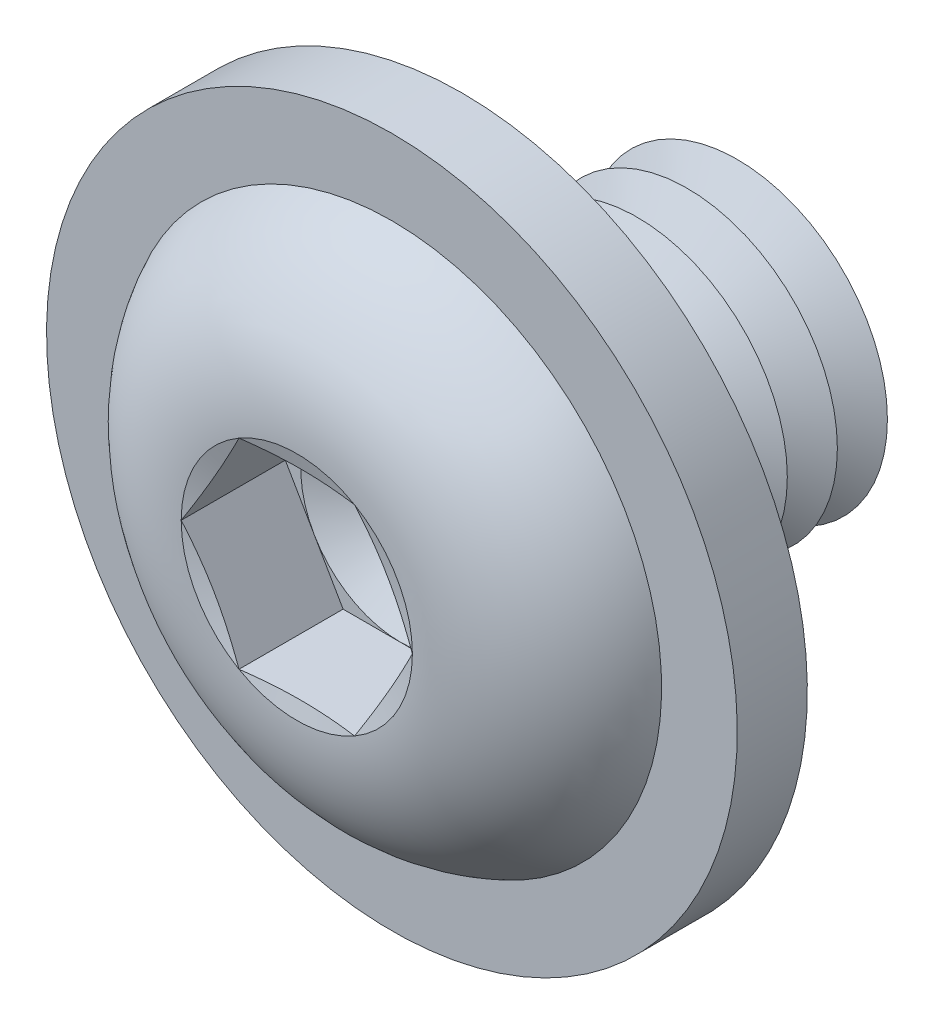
ISO-10303-21;
HEADER;
FILE_DESCRIPTION(('STEP AP214'),'2;1');
FILE_NAME('part.step','',(''),(''),'','','');
FILE_SCHEMA(('AUTOMOTIVE_DESIGN { 1 0 10303 214 1 1 1 1 }'));
ENDSEC;
DATA;
#1=APPLICATION_CONTEXT('core data for automotive mechanical design processes');
#2=APPLICATION_PROTOCOL_DEFINITION('international standard','automotive_design',2000,#1);
#3=PRODUCT_CONTEXT('',#1,'mechanical');
#4=PRODUCT('Part','Part','',(#3));
#5=PRODUCT_RELATED_PRODUCT_CATEGORY('part','',(#4));
#6=PRODUCT_DEFINITION_FORMATION('','',#4);
#7=PRODUCT_DEFINITION_CONTEXT('part definition',#1,'design');
#8=PRODUCT_DEFINITION('design','',#6,#7);
#9=PRODUCT_DEFINITION_SHAPE('','',#8);
#10=(LENGTH_UNIT() NAMED_UNIT(*) SI_UNIT(.MILLI.,.METRE.));
#11=(NAMED_UNIT(*) PLANE_ANGLE_UNIT() SI_UNIT($,.RADIAN.));
#12=(NAMED_UNIT(*) SI_UNIT($,.STERADIAN.) SOLID_ANGLE_UNIT());
#13=UNCERTAINTY_MEASURE_WITH_UNIT(LENGTH_MEASURE(1.E-05),#10,'distance_accuracy_value','');
#14=(GEOMETRIC_REPRESENTATION_CONTEXT(3) GLOBAL_UNCERTAINTY_ASSIGNED_CONTEXT((#13)) GLOBAL_UNIT_ASSIGNED_CONTEXT((#10,
#11,#12)) REPRESENTATION_CONTEXT('',''));
#15=CARTESIAN_POINT('',(0.,0.,0.));
#16=DIRECTION('',(0.,0.,1.));
#17=DIRECTION('',(1.,0.,0.));
#18=AXIS2_PLACEMENT_3D('',#15,#16,#17);
#19=CARTESIAN_POINT('',(0.,0.,-1.25));
#20=DIRECTION('',(0.,0.,1.));
#21=DIRECTION('',(1.,0.,0.));
#22=AXIS2_PLACEMENT_3D('',#19,#20,#21);
#23=CONICAL_SURFACE('',#22,1.5,1.0471975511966);
#24=CARTESIAN_POINT('',(0.,0.,-1.5));
#25=DIRECTION('',(0.,0.,1.));
#26=DIRECTION('',(1.,0.,0.));
#27=AXIS2_PLACEMENT_3D('',#24,#25,#26);
#28=CIRCLE('',#27,1.06698729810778);
#29=CARTESIAN_POINT('',(1.06698729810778,0.,-1.5));
#30=VERTEX_POINT('',#29);
#31=EDGE_CURVE('E259',#30,#30,#28,.T.);
#32=ORIENTED_EDGE('',*,*,#31,.T.);
#33=EDGE_LOOP('',(#32));
#34=FACE_BOUND('',#33,.T.);
#35=CARTESIAN_POINT('',(0.,0.,-1.25));
#36=DIRECTION('',(0.,0.,1.));
#37=DIRECTION('',(1.,0.,0.));
#38=AXIS2_PLACEMENT_3D('',#35,#36,#37);
#39=CIRCLE('',#38,1.5);
#40=CARTESIAN_POINT('',(1.5,0.,-1.25));
#41=VERTEX_POINT('',#40);
#42=EDGE_CURVE('E255',#41,#41,#39,.T.);
#43=ORIENTED_EDGE('',*,*,#42,.F.);
#44=EDGE_LOOP('',(#43));
#45=FACE_BOUND('',#44,.T.);
#46=ADVANCED_FACE('F39',(#34,#45),#23,.T.);
#47=CARTESIAN_POINT('',(0.,0.,-1.5));
#48=DIRECTION('',(0.,0.,-1.));
#49=DIRECTION('',(-1.,0.,0.));
#50=AXIS2_PLACEMENT_3D('',#47,#48,#49);
#51=CONICAL_SURFACE('',#50,1.06698729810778,1.0471975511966);
#52=CARTESIAN_POINT('',(0.,0.,-1.75));
#53=DIRECTION('',(0.,0.,1.));
#54=DIRECTION('',(1.,0.,0.));
#55=AXIS2_PLACEMENT_3D('',#52,#53,#54);
#56=CIRCLE('',#55,1.5);
#57=CARTESIAN_POINT('',(1.5,0.,-1.75));
#58=VERTEX_POINT('',#57);
#59=EDGE_CURVE('E263',#58,#58,#56,.T.);
#60=ORIENTED_EDGE('',*,*,#59,.T.);
#61=EDGE_LOOP('',(#60));
#62=FACE_BOUND('',#61,.T.);
#63=ORIENTED_EDGE('',*,*,#31,.F.);
#64=EDGE_LOOP('',(#63));
#65=FACE_BOUND('',#64,.T.);
#66=ADVANCED_FACE('F394',(#62,#65),#51,.T.);
#67=CARTESIAN_POINT('',(0.,1.5,-3.));
#68=DIRECTION('',(0.,0.,-1.));
#69=DIRECTION('',(-1.,0.,0.));
#70=AXIS2_PLACEMENT_3D('',#67,#68,#69);
#71=PLANE('',#70);
#72=CARTESIAN_POINT('',(0.,0.,-3.));
#73=DIRECTION('',(0.,0.,1.));
#74=DIRECTION('',(1.,0.,0.));
#75=AXIS2_PLACEMENT_3D('',#72,#73,#74);
#76=CIRCLE('',#75,1.06698729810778);
#77=CARTESIAN_POINT('',(1.06698729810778,0.,-3.));
#78=VERTEX_POINT('',#77);
#79=EDGE_CURVE('E283',#78,#78,#76,.T.);
#80=ORIENTED_EDGE('',*,*,#79,.F.);
#81=EDGE_LOOP('',(#80));
#82=FACE_BOUND('',#81,.T.);
#83=ADVANCED_FACE('F400',(#82),#71,.T.);
#84=CARTESIAN_POINT('',(0.,0.,-2.75));
#85=DIRECTION('',(0.,0.,1.));
#86=DIRECTION('',(1.,0.,0.));
#87=AXIS2_PLACEMENT_3D('',#84,#85,#86);
#88=CONICAL_SURFACE('',#87,1.5,1.0471975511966);
#89=ORIENTED_EDGE('',*,*,#79,.T.);
#90=EDGE_LOOP('',(#89));
#91=FACE_BOUND('',#90,.T.);
#92=CARTESIAN_POINT('',(0.,0.,-2.75));
#93=DIRECTION('',(0.,0.,1.));
#94=DIRECTION('',(1.,0.,0.));
#95=AXIS2_PLACEMENT_3D('',#92,#93,#94);
#96=CIRCLE('',#95,1.5);
#97=CARTESIAN_POINT('',(1.5,0.,-2.75));
#98=VERTEX_POINT('',#97);
#99=EDGE_CURVE('E279',#98,#98,#96,.T.);
#100=ORIENTED_EDGE('',*,*,#99,.F.);
#101=EDGE_LOOP('',(#100));
#102=FACE_BOUND('',#101,.T.);
#103=ADVANCED_FACE('F419',(#91,#102),#88,.T.);
#104=CARTESIAN_POINT('',(0.,0.,-2.5));
#105=DIRECTION('',(0.,0.,-1.));
#106=DIRECTION('',(-1.,0.,0.));
#107=AXIS2_PLACEMENT_3D('',#104,#105,#106);
#108=CONICAL_SURFACE('',#107,1.06698729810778,1.0471975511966);
#109=ORIENTED_EDGE('',*,*,#99,.T.);
#110=EDGE_LOOP('',(#109));
#111=FACE_BOUND('',#110,.T.);
#112=CARTESIAN_POINT('',(0.,0.,-2.5));
#113=DIRECTION('',(0.,0.,1.));
#114=DIRECTION('',(1.,0.,0.));
#115=AXIS2_PLACEMENT_3D('',#112,#113,#114);
#116=CIRCLE('',#115,1.06698729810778);
#117=CARTESIAN_POINT('',(1.06698729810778,0.,-2.5));
#118=VERTEX_POINT('',#117);
#119=EDGE_CURVE('E275',#118,#118,#116,.T.);
#120=ORIENTED_EDGE('',*,*,#119,.F.);
#121=EDGE_LOOP('',(#120));
#122=FACE_BOUND('',#121,.T.);
#123=ADVANCED_FACE('F416',(#111,#122),#108,.T.);
#124=CARTESIAN_POINT('',(0.,0.,-2.25));
#125=DIRECTION('',(0.,0.,1.));
#126=DIRECTION('',(1.,0.,0.));
#127=AXIS2_PLACEMENT_3D('',#124,#125,#126);
#128=CONICAL_SURFACE('',#127,1.5,1.0471975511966);
#129=ORIENTED_EDGE('',*,*,#119,.T.);
#130=EDGE_LOOP('',(#129));
#131=FACE_BOUND('',#130,.T.);
#132=CARTESIAN_POINT('',(0.,0.,-2.25));
#133=DIRECTION('',(0.,0.,1.));
#134=DIRECTION('',(1.,0.,0.));
#135=AXIS2_PLACEMENT_3D('',#132,#133,#134);
#136=CIRCLE('',#135,1.5);
#137=CARTESIAN_POINT('',(1.5,0.,-2.25));
#138=VERTEX_POINT('',#137);
#139=EDGE_CURVE('E271',#138,#138,#136,.T.);
#140=ORIENTED_EDGE('',*,*,#139,.F.);
#141=EDGE_LOOP('',(#140));
#142=FACE_BOUND('',#141,.T.);
#143=ADVANCED_FACE('F410',(#131,#142),#128,.T.);
#144=CARTESIAN_POINT('',(0.,0.,-2.));
#145=DIRECTION('',(0.,0.,-1.));
#146=DIRECTION('',(-1.,0.,0.));
#147=AXIS2_PLACEMENT_3D('',#144,#145,#146);
#148=CONICAL_SURFACE('',#147,1.06698729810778,1.0471975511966);
#149=ORIENTED_EDGE('',*,*,#139,.T.);
#150=EDGE_LOOP('',(#149));
#151=FACE_BOUND('',#150,.T.);
#152=CARTESIAN_POINT('',(0.,0.,-2.));
#153=DIRECTION('',(0.,0.,1.));
#154=DIRECTION('',(1.,0.,0.));
#155=AXIS2_PLACEMENT_3D('',#152,#153,#154);
#156=CIRCLE('',#155,1.06698729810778);
#157=CARTESIAN_POINT('',(1.06698729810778,0.,-2.));
#158=VERTEX_POINT('',#157);
#159=EDGE_CURVE('E267',#158,#158,#156,.T.);
#160=ORIENTED_EDGE('',*,*,#159,.F.);
#161=EDGE_LOOP('',(#160));
#162=FACE_BOUND('',#161,.T.);
#163=ADVANCED_FACE('F406',(#151,#162),#148,.T.);
#164=CARTESIAN_POINT('',(0.,0.,-1.75));
#165=DIRECTION('',(0.,0.,1.));
#166=DIRECTION('',(1.,0.,0.));
#167=AXIS2_PLACEMENT_3D('',#164,#165,#166);
#168=CONICAL_SURFACE('',#167,1.5,1.0471975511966);
#169=ORIENTED_EDGE('',*,*,#159,.T.);
#170=EDGE_LOOP('',(#169));
#171=FACE_BOUND('',#170,.T.);
#172=ORIENTED_EDGE('',*,*,#59,.F.);
#173=EDGE_LOOP('',(#172));
#174=FACE_BOUND('',#173,.T.);
#175=ADVANCED_FACE('F409',(#171,#174),#168,.T.);
#176=CARTESIAN_POINT('',(0.,0.,-0.750000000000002));
#177=DIRECTION('',(0.,0.,1.));
#178=DIRECTION('',(1.,0.,0.));
#179=AXIS2_PLACEMENT_3D('',#176,#177,#178);
#180=CONICAL_SURFACE('',#179,1.5,1.0471975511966);
#181=CARTESIAN_POINT('',(0.,0.,-1.));
#182=DIRECTION('',(0.,0.,1.));
#183=DIRECTION('',(1.,0.,0.));
#184=AXIS2_PLACEMENT_3D('',#181,#182,#183);
#185=CIRCLE('',#184,1.06698729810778);
#186=CARTESIAN_POINT('',(1.06698729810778,0.,-1.));
#187=VERTEX_POINT('',#186);
#188=EDGE_CURVE('E251',#187,#187,#185,.T.);
#189=ORIENTED_EDGE('',*,*,#188,.T.);
#190=EDGE_LOOP('',(#189));
#191=FACE_BOUND('',#190,.T.);
#192=CARTESIAN_POINT('',(0.,0.,-0.750000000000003));
#193=DIRECTION('',(0.,0.,1.));
#194=DIRECTION('',(1.,0.,0.));
#195=AXIS2_PLACEMENT_3D('',#192,#193,#194);
#196=CIRCLE('',#195,1.5);
#197=CARTESIAN_POINT('',(1.5,0.,-0.750000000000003));
#198=VERTEX_POINT('',#197);
#199=EDGE_CURVE('E243',#198,#198,#196,.T.);
#200=ORIENTED_EDGE('',*,*,#199,.F.);
#201=EDGE_LOOP('',(#200));
#202=FACE_BOUND('',#201,.T.);
#203=ADVANCED_FACE('F414',(#191,#202),#180,.T.);
#204=CARTESIAN_POINT('',(0.,0.,-1.));
#205=DIRECTION('',(0.,0.,-1.));
#206=DIRECTION('',(-1.,0.,0.));
#207=AXIS2_PLACEMENT_3D('',#204,#205,#206);
#208=CONICAL_SURFACE('',#207,1.06698729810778,1.0471975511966);
#209=ORIENTED_EDGE('',*,*,#42,.T.);
#210=EDGE_LOOP('',(#209));
#211=FACE_BOUND('',#210,.T.);
#212=ORIENTED_EDGE('',*,*,#188,.F.);
#213=EDGE_LOOP('',(#212));
#214=FACE_BOUND('',#213,.T.);
#215=ADVANCED_FACE('F465',(#211,#214),#208,.T.);
#216=CARTESIAN_POINT('',(0.,0.,-0.250000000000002));
#217=DIRECTION('',(0.,0.,1.));
#218=DIRECTION('',(1.,0.,0.));
#219=AXIS2_PLACEMENT_3D('',#216,#217,#218);
#220=CONICAL_SURFACE('',#219,1.5,1.0471975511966);
#221=CARTESIAN_POINT('',(0.,0.,-0.500000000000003));
#222=DIRECTION('',(0.,0.,1.));
#223=DIRECTION('',(1.,0.,0.));
#224=AXIS2_PLACEMENT_3D('',#221,#222,#223);
#225=CIRCLE('',#224,1.06698729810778);
#226=CARTESIAN_POINT('',(1.06698729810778,0.,-0.500000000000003));
#227=VERTEX_POINT('',#226);
#228=EDGE_CURVE('E232',#227,#227,#225,.T.);
#229=ORIENTED_EDGE('',*,*,#228,.T.);
#230=EDGE_LOOP('',(#229));
#231=FACE_BOUND('',#230,.T.);
#232=CARTESIAN_POINT('',(0.,0.,-0.250000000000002));
#233=DIRECTION('',(0.,0.,1.));
#234=DIRECTION('',(1.,0.,0.));
#235=AXIS2_PLACEMENT_3D('',#232,#233,#234);
#236=CIRCLE('',#235,1.5);
#237=CARTESIAN_POINT('',(1.5,0.,-0.250000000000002));
#238=VERTEX_POINT('',#237);
#239=EDGE_CURVE('E247',#238,#238,#236,.T.);
#240=ORIENTED_EDGE('',*,*,#239,.F.);
#241=EDGE_LOOP('',(#240));
#242=FACE_BOUND('',#241,.T.);
#243=ADVANCED_FACE('F471',(#231,#242),#220,.T.);
#244=CARTESIAN_POINT('',(0.,0.,-0.500000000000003));
#245=DIRECTION('',(0.,0.,-1.));
#246=DIRECTION('',(-1.,0.,0.));
#247=AXIS2_PLACEMENT_3D('',#244,#245,#246);
#248=CONICAL_SURFACE('',#247,1.06698729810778,1.0471975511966);
#249=ORIENTED_EDGE('',*,*,#199,.T.);
#250=EDGE_LOOP('',(#249));
#251=FACE_BOUND('',#250,.T.);
#252=ORIENTED_EDGE('',*,*,#228,.F.);
#253=EDGE_LOOP('',(#252));
#254=FACE_BOUND('',#253,.T.);
#255=ADVANCED_FACE('F221',(#251,#254),#248,.T.);
#256=CARTESIAN_POINT('',(0.,1.5,0.));
#257=DIRECTION('',(0.,0.,-1.));
#258=DIRECTION('',(-1.,0.,0.));
#259=AXIS2_PLACEMENT_3D('',#256,#257,#258);
#260=PLANE('',#259);
#261=CARTESIAN_POINT('',(0.,0.,0.));
#262=DIRECTION('',(0.,0.,-1.));
#263=DIRECTION('',(-1.,0.,0.));
#264=AXIS2_PLACEMENT_3D('',#261,#262,#263);
#265=CIRCLE('',#264,1.75);
#266=CARTESIAN_POINT('',(-1.75,0.,0.));
#267=VERTEX_POINT('',#266);
#268=EDGE_CURVE('E292',#267,#267,#265,.F.);
#269=ORIENTED_EDGE('',*,*,#268,.T.);
#270=EDGE_LOOP('',(#269));
#271=FACE_BOUND('',#270,.T.);
#272=CARTESIAN_POINT('',(0.,0.,0.));
#273=DIRECTION('',(0.,0.,-1.));
#274=DIRECTION('',(0.,1.,0.));
#275=AXIS2_PLACEMENT_3D('',#272,#273,#274);
#276=CIRCLE('',#275,3.45);
#277=CARTESIAN_POINT('',(0.,3.45,0.));
#278=VERTEX_POINT('',#277);
#279=EDGE_CURVE('E372',#278,#278,#276,.T.);
#280=ORIENTED_EDGE('',*,*,#279,.T.);
#281=EDGE_LOOP('',(#280));
#282=FACE_BOUND('',#281,.T.);
#283=ADVANCED_FACE('F483',(#271,#282),#260,.T.);
#284=CARTESIAN_POINT('',(0.,0.,-0.25));
#285=DIRECTION('',(0.,0.,-1.));
#286=DIRECTION('',(-1.,0.,0.));
#287=AXIS2_PLACEMENT_3D('',#284,#285,#286);
#288=TOROIDAL_SURFACE('',#287,1.75,0.25);
#289=ORIENTED_EDGE('',*,*,#268,.F.);
#290=EDGE_LOOP('',(#289));
#291=FACE_BOUND('',#290,.T.);
#292=ORIENTED_EDGE('',*,*,#239,.T.);
#293=EDGE_LOOP('',(#292));
#294=FACE_BOUND('',#293,.T.);
#295=ADVANCED_FACE('F41',(#291,#294),#288,.F.);
#296=CARTESIAN_POINT('',(0.,0.,0.7));
#297=DIRECTION('',(0.,0.,-1.));
#298=DIRECTION('',(0.,1.,0.));
#299=AXIS2_PLACEMENT_3D('',#296,#297,#298);
#300=CYLINDRICAL_SURFACE('',#299,3.45);
#301=CARTESIAN_POINT('',(0.,0.,0.7));
#302=DIRECTION('',(0.,0.,-1.));
#303=DIRECTION('',(0.,1.,0.));
#304=AXIS2_PLACEMENT_3D('',#301,#302,#303);
#305=CIRCLE('',#304,3.45);
#306=CARTESIAN_POINT('',(0.,3.45,0.7));
#307=VERTEX_POINT('',#306);
#308=EDGE_CURVE('E374',#307,#307,#305,.T.);
#309=ORIENTED_EDGE('',*,*,#308,.T.);
#310=EDGE_LOOP('',(#309));
#311=FACE_BOUND('',#310,.T.);
#312=ORIENTED_EDGE('',*,*,#279,.F.);
#313=EDGE_LOOP('',(#312));
#314=FACE_BOUND('',#313,.T.);
#315=ADVANCED_FACE('F387',(#311,#314),#300,.T.);
#316=CARTESIAN_POINT('',(0.,0.,0.7));
#317=DIRECTION('',(0.,0.,-1.));
#318=DIRECTION('',(0.,1.,0.));
#319=AXIS2_PLACEMENT_3D('',#316,#317,#318);
#320=PLANE('',#319);
#321=CARTESIAN_POINT('',(0.,0.,0.7));
#322=DIRECTION('',(0.,0.,-1.));
#323=DIRECTION('',(0.,1.,0.));
#324=AXIS2_PLACEMENT_3D('',#321,#322,#323);
#325=CIRCLE('',#324,2.69421838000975);
#326=CARTESIAN_POINT('',(0.,2.69421838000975,0.7));
#327=VERTEX_POINT('',#326);
#328=EDGE_CURVE('E43',#327,#327,#325,.F.);
#329=ORIENTED_EDGE('',*,*,#328,.F.);
#330=EDGE_LOOP('',(#329));
#331=FACE_BOUND('',#330,.T.);
#332=ORIENTED_EDGE('',*,*,#308,.F.);
#333=EDGE_LOOP('',(#332));
#334=FACE_BOUND('',#333,.T.);
#335=ADVANCED_FACE('F117',(#331,#334),#320,.F.);
#336=CARTESIAN_POINT('',(0.,0.,0.609999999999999));
#337=DIRECTION('',(0.,0.,1.));
#338=DIRECTION('',(1.,0.,0.));
#339=AXIS2_PLACEMENT_3D('',#336,#337,#338);
#340=CONICAL_SURFACE('',#339,0.99999953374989,1.0471975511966);
#341=CARTESIAN_POINT('',(0.,0.,0.0326500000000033));
#342=VERTEX_POINT('',#341);
#343=VERTEX_LOOP('',#342);
#344=FACE_BOUND('',#343,.T.);
#345=CARTESIAN_POINT('',(0.,0.,0.609999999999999));
#346=DIRECTION('',(0.,0.,1.));
#347=DIRECTION('',(1.,0.,0.));
#348=AXIS2_PLACEMENT_3D('',#345,#346,#347);
#349=CIRCLE('',#348,0.99999953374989);
#350=CARTESIAN_POINT('',(0.866024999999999,0.499999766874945,0.609999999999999));
#351=VERTEX_POINT('',#350);
#352=CARTESIAN_POINT('',(0.,0.99999953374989,0.609999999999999));
#353=VERTEX_POINT('',#352);
#354=EDGE_CURVE('E120',#351,#353,#349,.T.);
#355=ORIENTED_EDGE('',*,*,#354,.T.);
#356=CARTESIAN_POINT('',(0.,0.,0.609999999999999));
#357=DIRECTION('',(0.,0.,1.));
#358=DIRECTION('',(1.,0.,0.));
#359=AXIS2_PLACEMENT_3D('',#356,#357,#358);
#360=CIRCLE('',#359,0.99999953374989);
#361=CARTESIAN_POINT('',(-0.866024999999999,0.499999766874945,0.609999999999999));
#362=VERTEX_POINT('',#361);
#363=EDGE_CURVE('E11',#353,#362,#360,.T.);
#364=ORIENTED_EDGE('',*,*,#363,.T.);
#365=CARTESIAN_POINT('',(-0.866024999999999,-0.499999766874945,0.609999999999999));
#366=VERTEX_POINT('',#365);
#367=EDGE_CURVE('E49',#362,#366,#360,.T.);
#368=ORIENTED_EDGE('',*,*,#367,.T.);
#369=CARTESIAN_POINT('',(0.,-0.99999953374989,0.609999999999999));
#370=VERTEX_POINT('',#369);
#371=EDGE_CURVE('E298',#366,#370,#360,.T.);
#372=ORIENTED_EDGE('',*,*,#371,.T.);
#373=CARTESIAN_POINT('',(0.866024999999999,-0.499999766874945,0.609999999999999));
#374=VERTEX_POINT('',#373);
#375=EDGE_CURVE('E57',#370,#374,#360,.T.);
#376=ORIENTED_EDGE('',*,*,#375,.T.);
#377=EDGE_CURVE('E50',#374,#351,#360,.T.);
#378=ORIENTED_EDGE('',*,*,#377,.T.);
#379=EDGE_LOOP('',(#355,#364,#368,#372,#376,#378));
#380=FACE_BOUND('',#379,.T.);
#381=ADVANCED_FACE('F114',(#344,#380),#340,.F.);
#382=CARTESIAN_POINT('',(0.,0.,0.609999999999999));
#383=DIRECTION('',(0.,0.,1.));
#384=DIRECTION('',(1.,0.,0.));
#385=AXIS2_PLACEMENT_3D('',#382,#383,#384);
#386=PLANE('',#385);
#387=ORIENTED_EDGE('',*,*,#371,.F.);
#388=DIRECTION('',(0.5,-0.866025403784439,0.));
#389=VECTOR('',#388,1.);
#390=CARTESIAN_POINT('',(-1.1547,0.,0.609999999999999));
#391=LINE('',#390,#389);
#392=CARTESIAN_POINT('',(-0.577349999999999,-0.99999953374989,0.609999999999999));
#393=VERTEX_POINT('',#392);
#394=EDGE_CURVE('E154',#366,#393,#391,.T.);
#395=ORIENTED_EDGE('',*,*,#394,.T.);
#396=DIRECTION('',(1.,0.,0.));
#397=VECTOR('',#396,1.);
#398=CARTESIAN_POINT('',(-0.577349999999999,-0.99999953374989,0.609999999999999));
#399=LINE('',#398,#397);
#400=EDGE_CURVE('E160',#393,#370,#399,.T.);
#401=ORIENTED_EDGE('',*,*,#400,.T.);
#402=EDGE_LOOP('',(#387,#395,#401));
#403=FACE_BOUND('',#402,.T.);
#404=ADVANCED_FACE('F116',(#403),#386,.T.);
#405=ORIENTED_EDGE('',*,*,#375,.F.);
#406=CARTESIAN_POINT('',(0.577349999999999,-0.99999953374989,0.609999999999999));
#407=VERTEX_POINT('',#406);
#408=EDGE_CURVE('E159',#370,#407,#399,.T.);
#409=ORIENTED_EDGE('',*,*,#408,.T.);
#410=DIRECTION('',(0.5,0.866025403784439,0.));
#411=VECTOR('',#410,1.);
#412=CARTESIAN_POINT('',(0.577349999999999,-0.99999953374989,0.609999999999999));
#413=LINE('',#412,#411);
#414=EDGE_CURVE('E165',#407,#374,#413,.T.);
#415=ORIENTED_EDGE('',*,*,#414,.T.);
#416=EDGE_LOOP('',(#405,#409,#415));
#417=FACE_BOUND('',#416,.T.);
#418=ADVANCED_FACE('F356',(#417),#386,.T.);
#419=ORIENTED_EDGE('',*,*,#377,.F.);
#420=CARTESIAN_POINT('',(1.1547,0.,0.609999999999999));
#421=VERTEX_POINT('',#420);
#422=EDGE_CURVE('E164',#374,#421,#413,.T.);
#423=ORIENTED_EDGE('',*,*,#422,.T.);
#424=DIRECTION('',(-0.5,0.866025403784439,0.));
#425=VECTOR('',#424,1.);
#426=CARTESIAN_POINT('',(1.1547,0.,0.609999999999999));
#427=LINE('',#426,#425);
#428=EDGE_CURVE('E142',#421,#351,#427,.T.);
#429=ORIENTED_EDGE('',*,*,#428,.T.);
#430=EDGE_LOOP('',(#419,#423,#429));
#431=FACE_BOUND('',#430,.T.);
#432=ADVANCED_FACE('F368',(#431),#386,.T.);
#433=ORIENTED_EDGE('',*,*,#354,.F.);
#434=CARTESIAN_POINT('',(0.577349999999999,0.99999953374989,0.609999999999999));
#435=VERTEX_POINT('',#434);
#436=EDGE_CURVE('E127',#351,#435,#427,.T.);
#437=ORIENTED_EDGE('',*,*,#436,.T.);
#438=DIRECTION('',(-1.,0.,0.));
#439=VECTOR('',#438,1.);
#440=CARTESIAN_POINT('',(0.577349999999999,0.99999953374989,0.609999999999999));
#441=LINE('',#440,#439);
#442=EDGE_CURVE('E138',#435,#353,#441,.T.);
#443=ORIENTED_EDGE('',*,*,#442,.T.);
#444=EDGE_LOOP('',(#433,#437,#443));
#445=FACE_BOUND('',#444,.T.);
#446=ADVANCED_FACE('F144',(#445),#386,.T.);
#447=ORIENTED_EDGE('',*,*,#363,.F.);
#448=CARTESIAN_POINT('',(-0.577350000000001,0.999999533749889,0.609999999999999));
#449=VERTEX_POINT('',#448);
#450=EDGE_CURVE('E133',#353,#449,#441,.T.);
#451=ORIENTED_EDGE('',*,*,#450,.T.);
#452=DIRECTION('',(-0.5,-0.866025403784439,0.));
#453=VECTOR('',#452,1.);
#454=CARTESIAN_POINT('',(-0.577350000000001,0.999999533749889,0.609999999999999));
#455=LINE('',#454,#453);
#456=EDGE_CURVE('E136',#449,#362,#455,.T.);
#457=ORIENTED_EDGE('',*,*,#456,.T.);
#458=EDGE_LOOP('',(#447,#451,#457));
#459=FACE_BOUND('',#458,.T.);
#460=ADVANCED_FACE('F132',(#459),#386,.T.);
#461=ORIENTED_EDGE('',*,*,#367,.F.);
#462=CARTESIAN_POINT('',(-1.1547,0.,0.609999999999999));
#463=VERTEX_POINT('',#462);
#464=EDGE_CURVE('E146',#362,#463,#455,.T.);
#465=ORIENTED_EDGE('',*,*,#464,.T.);
#466=EDGE_CURVE('E155',#463,#366,#391,.T.);
#467=ORIENTED_EDGE('',*,*,#466,.T.);
#468=EDGE_LOOP('',(#461,#465,#467));
#469=FACE_BOUND('',#468,.T.);
#470=ADVANCED_FACE('F316',(#469),#386,.T.);
#471=CARTESIAN_POINT('',(-1.1547,0.,0.609999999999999));
#472=DIRECTION('',(-0.866025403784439,-0.5,0.));
#473=DIRECTION('',(0.5,-0.866025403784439,0.));
#474=AXIS2_PLACEMENT_3D('',#471,#472,#473);
#475=PLANE('',#474);
#476=CARTESIAN_POINT('',(-1.15481547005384,0.000200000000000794,1.65003094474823));
#477=CARTESIAN_POINT('',(-1.13083002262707,-0.0413440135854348,1.64359970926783));
#478=CARTESIAN_POINT('',(-1.10680107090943,-0.0829633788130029,1.63776108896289));
#479=CARTESIAN_POINT('',(-1.05865826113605,-0.166349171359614,1.62750303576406));
#480=CARTESIAN_POINT('',(-1.03454437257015,-0.208115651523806,1.62308418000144));
#481=CARTESIAN_POINT('',(-0.986377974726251,-0.291542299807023,1.61592375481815));
#482=CARTESIAN_POINT('',(-0.962325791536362,-0.333201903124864,1.61317364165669));
#483=CARTESIAN_POINT('',(-0.914190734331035,-0.416574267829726,1.60948600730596));
#484=CARTESIAN_POINT('',(-0.890107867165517,-0.458287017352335,1.60854813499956));
#485=CARTESIAN_POINT('',(-0.841942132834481,-0.541712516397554,1.60854813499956));
#486=CARTESIAN_POINT('',(-0.817859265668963,-0.583425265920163,1.60948600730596));
#487=CARTESIAN_POINT('',(-0.769724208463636,-0.666797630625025,1.61317364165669));
#488=CARTESIAN_POINT('',(-0.745672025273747,-0.708457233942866,1.61592375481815));
#489=CARTESIAN_POINT('',(-0.697505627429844,-0.791883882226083,1.62308418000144));
#490=CARTESIAN_POINT('',(-0.673391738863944,-0.833650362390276,1.62750303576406));
#491=CARTESIAN_POINT('',(-0.625248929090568,-0.917036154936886,1.63776108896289));
#492=CARTESIAN_POINT('',(-0.60121997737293,-0.958655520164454,1.64359970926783));
#493=CARTESIAN_POINT('',(-0.577234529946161,-1.00019953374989,1.65003094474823));
#494=B_SPLINE_CURVE_WITH_KNOTS('',3,(#476,#477,#478,#479,#480,#481,#482,#483,#484,#485,#486,
#487,#488,#489,#490,#491,#492,#493),.UNSPECIFIED.,.F.,.F.,(4,2,2,2,2,2,2,2,4),(0.,
0.145207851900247,0.290474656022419,0.434991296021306,0.579479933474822,0.723968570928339,
0.868485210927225,1.0137520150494,1.15895986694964),.UNSPECIFIED.);
#495=CARTESIAN_POINT('',(-1.1547,0.,1.65));
#496=VERTEX_POINT('',#495);
#497=CARTESIAN_POINT('',(-0.577349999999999,-0.99999953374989,1.65));
#498=VERTEX_POINT('',#497);
#499=EDGE_CURVE('E321',#496,#498,#494,.T.);
#500=ORIENTED_EDGE('',*,*,#499,.T.);
#501=DIRECTION('',(0.,0.,1.));
#502=VECTOR('',#501,1.);
#503=CARTESIAN_POINT('',(-0.577349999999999,-0.99999953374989,0.609999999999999));
#504=LINE('',#503,#502);
#505=EDGE_CURVE('E178',#393,#498,#504,.T.);
#506=ORIENTED_EDGE('',*,*,#505,.F.);
#507=ORIENTED_EDGE('',*,*,#394,.F.);
#508=ORIENTED_EDGE('',*,*,#466,.F.);
#509=DIRECTION('',(0.,0.,1.));
#510=VECTOR('',#509,1.);
#511=CARTESIAN_POINT('',(-1.1547,0.,0.609999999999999));
#512=LINE('',#511,#510);
#513=EDGE_CURVE('E182',#463,#496,#512,.T.);
#514=ORIENTED_EDGE('',*,*,#513,.T.);
#515=EDGE_LOOP('',(#500,#506,#507,#508,#514));
#516=FACE_BOUND('',#515,.T.);
#517=ADVANCED_FACE('F314',(#516),#475,.F.);
#518=CARTESIAN_POINT('',(-0.577349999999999,-0.99999953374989,0.609999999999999));
#519=DIRECTION('',(0.,-1.,0.));
#520=DIRECTION('',(0.,0.,-1.));
#521=AXIS2_PLACEMENT_3D('',#518,#519,#520);
#522=PLANE('',#521);
#523=CARTESIAN_POINT('',(-1.7425668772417,-0.99999953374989,1.87893949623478));
#524=CARTESIAN_POINT('',(-1.65819693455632,-0.99999953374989,1.85935934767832));
#525=CARTESIAN_POINT('',(-1.57375647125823,-0.99999953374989,1.84006351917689));
#526=CARTESIAN_POINT('',(-1.40464514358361,-0.99999953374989,1.80242908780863));
#527=CARTESIAN_POINT('',(-1.31997423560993,-0.99999953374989,1.78409068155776));
#528=CARTESIAN_POINT('',(-1.14955192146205,-0.99999953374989,1.74860242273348));
#529=CARTESIAN_POINT('',(-1.06379782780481,-0.99999953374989,1.73146532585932));
#530=CARTESIAN_POINT('',(-0.891887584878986,-0.99999953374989,1.69925819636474));
#531=CARTESIAN_POINT('',(-0.805731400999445,-0.99999953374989,1.68418834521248));
#532=CARTESIAN_POINT('',(-0.635256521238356,-0.99999953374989,1.65751615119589));
#533=CARTESIAN_POINT('',(-0.550951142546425,-0.99999953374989,1.64583105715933));
#534=CARTESIAN_POINT('',(-0.381865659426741,-0.99999953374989,1.62668811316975));
#535=CARTESIAN_POINT('',(-0.297085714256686,-0.99999953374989,1.61922892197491));
#536=CARTESIAN_POINT('',(-0.127577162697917,-0.99999953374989,1.60981453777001));
#537=CARTESIAN_POINT('',(-0.0428499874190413,-0.99999953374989,1.60783514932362));
#538=CARTESIAN_POINT('',(0.126542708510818,-0.99999953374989,1.60973012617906));
#539=CARTESIAN_POINT('',(0.211208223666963,-0.99999953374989,1.61360496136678));
#540=CARTESIAN_POINT('',(0.356115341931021,-0.99999953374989,1.62460226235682));
#541=CARTESIAN_POINT('',(0.416458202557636,-0.99999953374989,1.63048841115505));
#542=CARTESIAN_POINT('',(0.536893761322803,-0.99999953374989,1.64437752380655));
#543=CARTESIAN_POINT('',(0.596986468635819,-0.99999953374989,1.65238040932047));
#544=CARTESIAN_POINT('',(0.777275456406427,-0.99999953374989,1.67888855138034));
#545=CARTESIAN_POINT('',(0.897104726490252,-0.99999953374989,1.69985858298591));
#546=CARTESIAN_POINT('',(1.07751611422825,-0.99999953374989,1.73433574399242));
#547=CARTESIAN_POINT('',(1.1383777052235,-0.99999953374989,1.74646914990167));
#548=CARTESIAN_POINT('',(1.25994955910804,-0.99999953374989,1.7714845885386));
#549=CARTESIAN_POINT('',(1.32065982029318,-0.99999953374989,1.7843666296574));
#550=CARTESIAN_POINT('',(1.44162663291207,-0.99999953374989,1.81062164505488));
#551=CARTESIAN_POINT('',(1.50188385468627,-0.99999953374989,1.82399156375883));
#552=CARTESIAN_POINT('',(1.62229550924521,-0.99999953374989,1.85116781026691));
#553=CARTESIAN_POINT('',(1.68244994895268,-0.99999953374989,1.86497410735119));
#554=CARTESIAN_POINT('',(1.7425668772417,-0.99999953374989,1.87893949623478));
#555=B_SPLINE_CURVE_WITH_KNOTS('',3,(#523,#524,#525,#526,#527,#528,#529,#530,#531,#532,#533,
#534,#535,#536,#537,#538,#539,#540,#541,#542,#543,#544,#545,#546,#547,#548,#549,#550,#551,#552,
#553,#554),.UNSPECIFIED.,.F.,.F.,(4,2,2,2,2,2,2,2,2,2,2,2,2,2,2,4),(0.,0.259842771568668,
0.519738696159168,0.782071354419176,1.04442702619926,1.29968778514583,1.55486748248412,
1.80891865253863,2.06299021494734,2.24483732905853,2.42667771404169,2.79149503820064,
2.97767344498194,3.16385393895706,3.34902052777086,3.53417411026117),.UNSPECIFIED.);
#556=CARTESIAN_POINT('',(0.577349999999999,-0.99999953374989,1.65));
#557=VERTEX_POINT('',#556);
#558=EDGE_CURVE('E328',#498,#557,#555,.T.);
#559=ORIENTED_EDGE('',*,*,#558,.T.);
#560=DIRECTION('',(0.,0.,1.));
#561=VECTOR('',#560,1.);
#562=CARTESIAN_POINT('',(0.577349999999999,-0.99999953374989,0.609999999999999));
#563=LINE('',#562,#561);
#564=EDGE_CURVE('E174',#407,#557,#563,.T.);
#565=ORIENTED_EDGE('',*,*,#564,.F.);
#566=ORIENTED_EDGE('',*,*,#408,.F.);
#567=ORIENTED_EDGE('',*,*,#400,.F.);
#568=ORIENTED_EDGE('',*,*,#505,.T.);
#569=EDGE_LOOP('',(#559,#565,#566,#567,#568));
#570=FACE_BOUND('',#569,.T.);
#571=ADVANCED_FACE('F359',(#570),#522,.F.);
#572=CARTESIAN_POINT('',(0.577349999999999,-0.99999953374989,0.609999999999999));
#573=DIRECTION('',(0.866025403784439,-0.5,0.));
#574=DIRECTION('',(0.5,0.866025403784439,0.));
#575=AXIS2_PLACEMENT_3D('',#572,#573,#574);
#576=PLANE('',#575);
#577=CARTESIAN_POINT('',(0.577234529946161,-1.00019953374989,1.65003094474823));
#578=CARTESIAN_POINT('',(0.601219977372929,-0.958655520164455,1.64359970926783));
#579=CARTESIAN_POINT('',(0.625248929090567,-0.917036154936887,1.63776108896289));
#580=CARTESIAN_POINT('',(0.673391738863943,-0.833650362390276,1.62750303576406));
#581=CARTESIAN_POINT('',(0.697505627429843,-0.791883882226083,1.62308418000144));
#582=CARTESIAN_POINT('',(0.745672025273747,-0.708457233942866,1.61592375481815));
#583=CARTESIAN_POINT('',(0.769724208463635,-0.666797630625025,1.61317364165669));
#584=CARTESIAN_POINT('',(0.817859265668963,-0.583425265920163,1.60948600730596));
#585=CARTESIAN_POINT('',(0.841942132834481,-0.541712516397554,1.60854813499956));
#586=CARTESIAN_POINT('',(0.890107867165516,-0.458287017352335,1.60854813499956));
#587=CARTESIAN_POINT('',(0.914190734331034,-0.416574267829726,1.60948600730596));
#588=CARTESIAN_POINT('',(0.962325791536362,-0.333201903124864,1.61317364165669));
#589=CARTESIAN_POINT('',(0.986377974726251,-0.291542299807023,1.61592375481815));
#590=CARTESIAN_POINT('',(1.03454437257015,-0.208115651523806,1.62308418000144));
#591=CARTESIAN_POINT('',(1.05865826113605,-0.166349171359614,1.62750303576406));
#592=CARTESIAN_POINT('',(1.10680107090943,-0.0829633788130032,1.63776108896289));
#593=CARTESIAN_POINT('',(1.13083002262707,-0.0413440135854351,1.64359970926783));
#594=CARTESIAN_POINT('',(1.15481547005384,0.0002000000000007,1.65003094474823));
#595=B_SPLINE_CURVE_WITH_KNOTS('',3,(#577,#578,#579,#580,#581,#582,#583,#584,#585,#586,#587,
#588,#589,#590,#591,#592,#593,#594),.UNSPECIFIED.,.F.,.F.,(4,2,2,2,2,2,2,2,4),(0.,
0.145207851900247,0.290474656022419,0.434991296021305,0.579479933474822,0.723968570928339,
0.868485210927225,1.0137520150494,1.15895986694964),.UNSPECIFIED.);
#596=CARTESIAN_POINT('',(1.1547,0.,1.65));
#597=VERTEX_POINT('',#596);
#598=EDGE_CURVE('E233',#557,#597,#595,.T.);
#599=ORIENTED_EDGE('',*,*,#598,.T.);
#600=DIRECTION('',(0.,0.,1.));
#601=VECTOR('',#600,1.);
#602=CARTESIAN_POINT('',(1.1547,0.,0.609999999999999));
#603=LINE('',#602,#601);
#604=EDGE_CURVE('E169',#421,#597,#603,.T.);
#605=ORIENTED_EDGE('',*,*,#604,.F.);
#606=ORIENTED_EDGE('',*,*,#422,.F.);
#607=ORIENTED_EDGE('',*,*,#414,.F.);
#608=ORIENTED_EDGE('',*,*,#564,.T.);
#609=EDGE_LOOP('',(#599,#605,#606,#607,#608));
#610=FACE_BOUND('',#609,.T.);
#611=ADVANCED_FACE('F219',(#610),#576,.F.);
#612=CARTESIAN_POINT('',(1.1547,0.,0.609999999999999));
#613=DIRECTION('',(0.866025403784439,0.5,0.));
#614=DIRECTION('',(-0.5,0.866025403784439,0.));
#615=AXIS2_PLACEMENT_3D('',#612,#613,#614);
#616=PLANE('',#615);
#617=CARTESIAN_POINT('',(1.15481547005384,-0.000199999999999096,1.65003094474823));
#618=CARTESIAN_POINT('',(1.13083002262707,0.0413440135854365,1.64359970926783));
#619=CARTESIAN_POINT('',(1.10680107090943,0.0829633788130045,1.63776108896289));
#620=CARTESIAN_POINT('',(1.05865826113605,0.166349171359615,1.62750303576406));
#621=CARTESIAN_POINT('',(1.03454437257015,0.208115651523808,1.62308418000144));
#622=CARTESIAN_POINT('',(0.986377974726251,0.291542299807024,1.61592375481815));
#623=CARTESIAN_POINT('',(0.962325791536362,0.333201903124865,1.61317364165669));
#624=CARTESIAN_POINT('',(0.914190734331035,0.416574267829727,1.60948600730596));
#625=CARTESIAN_POINT('',(0.890107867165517,0.458287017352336,1.60854813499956));
#626=CARTESIAN_POINT('',(0.841942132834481,0.541712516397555,1.60854813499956));
#627=CARTESIAN_POINT('',(0.817859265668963,0.583425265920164,1.60948600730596));
#628=CARTESIAN_POINT('',(0.769724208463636,0.666797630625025,1.61317364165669));
#629=CARTESIAN_POINT('',(0.745672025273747,0.708457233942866,1.61592375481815));
#630=CARTESIAN_POINT('',(0.697505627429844,0.791883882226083,1.62308418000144));
#631=CARTESIAN_POINT('',(0.673391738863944,0.833650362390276,1.62750303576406));
#632=CARTESIAN_POINT('',(0.625248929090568,0.917036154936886,1.63776108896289));
#633=CARTESIAN_POINT('',(0.60121997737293,0.958655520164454,1.64359970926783));
#634=CARTESIAN_POINT('',(0.577234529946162,1.00019953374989,1.65003094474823));
#635=B_SPLINE_CURVE_WITH_KNOTS('',3,(#617,#618,#619,#620,#621,#622,#623,#624,#625,#626,#627,
#628,#629,#630,#631,#632,#633,#634),.UNSPECIFIED.,.F.,.F.,(4,2,2,2,2,2,2,2,4),(0.,
0.145207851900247,0.290474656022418,0.434991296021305,0.579479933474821,0.723968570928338,
0.868485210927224,1.0137520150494,1.15895986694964),.UNSPECIFIED.);
#636=CARTESIAN_POINT('',(0.577349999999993,0.999999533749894,1.65));
#637=VERTEX_POINT('',#636);
#638=EDGE_CURVE('E224',#597,#637,#635,.T.);
#639=ORIENTED_EDGE('',*,*,#638,.T.);
#640=DIRECTION('',(0.,0.,1.));
#641=VECTOR('',#640,1.);
#642=CARTESIAN_POINT('',(0.577349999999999,0.99999953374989,0.609999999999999));
#643=LINE('',#642,#641);
#644=EDGE_CURVE('E65',#435,#637,#643,.T.);
#645=ORIENTED_EDGE('',*,*,#644,.F.);
#646=ORIENTED_EDGE('',*,*,#436,.F.);
#647=ORIENTED_EDGE('',*,*,#428,.F.);
#648=ORIENTED_EDGE('',*,*,#604,.T.);
#649=EDGE_LOOP('',(#639,#645,#646,#647,#648));
#650=FACE_BOUND('',#649,.T.);
#651=ADVANCED_FACE('F213',(#650),#616,.F.);
#652=CARTESIAN_POINT('',(0.577349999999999,0.99999953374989,0.609999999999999));
#653=DIRECTION('',(0.,1.,0.));
#654=DIRECTION('',(-1.,0.,0.));
#655=AXIS2_PLACEMENT_3D('',#652,#653,#654);
#656=PLANE('',#655);
#657=CARTESIAN_POINT('',(1.7425668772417,0.99999953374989,1.87893949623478));
#658=CARTESIAN_POINT('',(1.65819693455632,0.999999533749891,1.85935934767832));
#659=CARTESIAN_POINT('',(1.57375647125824,0.99999953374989,1.84006351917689));
#660=CARTESIAN_POINT('',(1.40464514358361,0.99999953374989,1.80242908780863));
#661=CARTESIAN_POINT('',(1.31997423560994,0.99999953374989,1.78409068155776));
#662=CARTESIAN_POINT('',(1.14955192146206,0.99999953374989,1.74860242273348));
#663=CARTESIAN_POINT('',(1.06379782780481,0.99999953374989,1.73146532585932));
#664=CARTESIAN_POINT('',(0.891887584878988,0.99999953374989,1.69925819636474));
#665=CARTESIAN_POINT('',(0.805731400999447,0.99999953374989,1.68418834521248));
#666=CARTESIAN_POINT('',(0.635256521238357,0.99999953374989,1.65751615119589));
#667=CARTESIAN_POINT('',(0.550951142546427,0.99999953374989,1.64583105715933));
#668=CARTESIAN_POINT('',(0.381865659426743,0.99999953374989,1.62668811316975));
#669=CARTESIAN_POINT('',(0.297085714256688,0.99999953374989,1.61922892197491));
#670=CARTESIAN_POINT('',(0.127577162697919,0.99999953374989,1.60981453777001));
#671=CARTESIAN_POINT('',(0.0428499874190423,0.99999953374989,1.60783514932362));
#672=CARTESIAN_POINT('',(-0.126542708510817,0.99999953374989,1.60973012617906));
#673=CARTESIAN_POINT('',(-0.211208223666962,0.999999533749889,1.61360496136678));
#674=CARTESIAN_POINT('',(-0.356115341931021,0.999999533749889,1.62460226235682));
#675=CARTESIAN_POINT('',(-0.416458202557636,0.999999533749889,1.63048841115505));
#676=CARTESIAN_POINT('',(-0.536893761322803,0.999999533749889,1.64437752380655));
#677=CARTESIAN_POINT('',(-0.596986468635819,0.999999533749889,1.65238040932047));
#678=CARTESIAN_POINT('',(-0.777275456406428,0.999999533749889,1.67888855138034));
#679=CARTESIAN_POINT('',(-0.897104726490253,0.999999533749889,1.69985858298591));
#680=CARTESIAN_POINT('',(-1.07751611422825,0.999999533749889,1.73433574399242));
#681=CARTESIAN_POINT('',(-1.1383777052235,0.999999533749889,1.74646914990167));
#682=CARTESIAN_POINT('',(-1.25994955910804,0.999999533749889,1.7714845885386));
#683=CARTESIAN_POINT('',(-1.32065982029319,0.999999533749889,1.7843666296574));
#684=CARTESIAN_POINT('',(-1.44162663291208,0.999999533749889,1.81062164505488));
#685=CARTESIAN_POINT('',(-1.50188385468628,0.999999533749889,1.82399156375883));
#686=CARTESIAN_POINT('',(-1.62229550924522,0.999999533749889,1.85116781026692));
#687=CARTESIAN_POINT('',(-1.68244994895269,0.999999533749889,1.86497410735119));
#688=CARTESIAN_POINT('',(-1.7425668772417,0.999999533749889,1.87893949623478));
#689=B_SPLINE_CURVE_WITH_KNOTS('',3,(#657,#658,#659,#660,#661,#662,#663,#664,#665,#666,#667,
#668,#669,#670,#671,#672,#673,#674,#675,#676,#677,#678,#679,#680,#681,#682,#683,#684,#685,#686,
#687,#688),.UNSPECIFIED.,.F.,.F.,(4,2,2,2,2,2,2,2,2,2,2,2,2,2,2,4),(0.,0.259842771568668,
0.519738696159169,0.782071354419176,1.04442702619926,1.29968778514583,1.55486748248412,
1.80891865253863,2.06299021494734,2.24483732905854,2.42667771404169,2.79149503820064,
2.97767344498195,3.16385393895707,3.34902052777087,3.53417411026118),.UNSPECIFIED.);
#690=CARTESIAN_POINT('',(-0.577350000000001,0.999999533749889,1.65));
#691=VERTEX_POINT('',#690);
#692=EDGE_CURVE('E173',#637,#691,#689,.T.);
#693=ORIENTED_EDGE('',*,*,#692,.T.);
#694=DIRECTION('',(0.,0.,1.));
#695=VECTOR('',#694,1.);
#696=CARTESIAN_POINT('',(-0.577350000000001,0.999999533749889,0.609999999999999));
#697=LINE('',#696,#695);
#698=EDGE_CURVE('E140',#449,#691,#697,.T.);
#699=ORIENTED_EDGE('',*,*,#698,.F.);
#700=ORIENTED_EDGE('',*,*,#450,.F.);
#701=ORIENTED_EDGE('',*,*,#442,.F.);
#702=ORIENTED_EDGE('',*,*,#644,.T.);
#703=EDGE_LOOP('',(#693,#699,#700,#701,#702));
#704=FACE_BOUND('',#703,.T.);
#705=ADVANCED_FACE('F137',(#704),#656,.F.);
#706=CARTESIAN_POINT('',(-0.577350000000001,0.999999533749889,0.609999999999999));
#707=DIRECTION('',(-0.866025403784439,0.5,0.));
#708=DIRECTION('',(-0.5,-0.866025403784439,0.));
#709=AXIS2_PLACEMENT_3D('',#706,#707,#708);
#710=PLANE('',#709);
#711=CARTESIAN_POINT('',(-0.577234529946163,1.00019953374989,1.65003094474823));
#712=CARTESIAN_POINT('',(-0.601219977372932,0.958655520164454,1.64359970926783));
#713=CARTESIAN_POINT('',(-0.625248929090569,0.917036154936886,1.63776108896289));
#714=CARTESIAN_POINT('',(-0.673391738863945,0.833650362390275,1.62750303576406));
#715=CARTESIAN_POINT('',(-0.697505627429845,0.791883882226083,1.62308418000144));
#716=CARTESIAN_POINT('',(-0.745672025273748,0.708457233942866,1.61592375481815));
#717=CARTESIAN_POINT('',(-0.769724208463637,0.666797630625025,1.61317364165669));
#718=CARTESIAN_POINT('',(-0.817859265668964,0.583425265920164,1.60948600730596));
#719=CARTESIAN_POINT('',(-0.841942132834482,0.541712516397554,1.60854813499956));
#720=CARTESIAN_POINT('',(-0.890107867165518,0.458287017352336,1.60854813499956));
#721=CARTESIAN_POINT('',(-0.914190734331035,0.416574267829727,1.60948600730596));
#722=CARTESIAN_POINT('',(-0.962325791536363,0.333201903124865,1.61317364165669));
#723=CARTESIAN_POINT('',(-0.986377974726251,0.291542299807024,1.61592375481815));
#724=CARTESIAN_POINT('',(-1.03454437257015,0.208115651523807,1.62308418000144));
#725=CARTESIAN_POINT('',(-1.05865826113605,0.166349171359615,1.62750303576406));
#726=CARTESIAN_POINT('',(-1.10680107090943,0.0829633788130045,1.63776108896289));
#727=CARTESIAN_POINT('',(-1.13083002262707,0.0413440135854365,1.64359970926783));
#728=CARTESIAN_POINT('',(-1.15481547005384,-0.00019999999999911,1.65003094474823));
#729=B_SPLINE_CURVE_WITH_KNOTS('',3,(#711,#712,#713,#714,#715,#716,#717,#718,#719,#720,#721,
#722,#723,#724,#725,#726,#727,#728),.UNSPECIFIED.,.F.,.F.,(4,2,2,2,2,2,2,2,4),(0.,
0.145207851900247,0.290474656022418,0.434991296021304,0.579479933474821,0.723968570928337,
0.868485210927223,1.01375201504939,1.15895986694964),.UNSPECIFIED.);
#730=EDGE_CURVE('E198',#691,#496,#729,.T.);
#731=ORIENTED_EDGE('',*,*,#730,.T.);
#732=ORIENTED_EDGE('',*,*,#513,.F.);
#733=ORIENTED_EDGE('',*,*,#464,.F.);
#734=ORIENTED_EDGE('',*,*,#456,.F.);
#735=ORIENTED_EDGE('',*,*,#698,.T.);
#736=EDGE_LOOP('',(#731,#732,#733,#734,#735));
#737=FACE_BOUND('',#736,.T.);
#738=ADVANCED_FACE('F212',(#737),#710,.F.);
#739=CARTESIAN_POINT('',(0.,0.,1.65));
#740=DIRECTION('',(0.,0.,1.));
#741=DIRECTION('',(1.,0.,0.));
#742=AXIS2_PLACEMENT_3D('',#739,#740,#741);
#743=CONICAL_SURFACE('',#742,1.1547,1.30899693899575);
#744=ORIENTED_EDGE('',*,*,#499,.F.);
#745=CARTESIAN_POINT('',(0.,0.,1.65));
#746=DIRECTION('',(0.,0.,-1.));
#747=DIRECTION('',(-1.,0.,0.));
#748=AXIS2_PLACEMENT_3D('',#745,#746,#747);
#749=CIRCLE('',#748,1.1547);
#750=EDGE_CURVE('E287',#498,#496,#749,.T.);
#751=ORIENTED_EDGE('',*,*,#750,.F.);
#752=EDGE_LOOP('',(#744,#751));
#753=FACE_BOUND('',#752,.T.);
#754=ADVANCED_FACE('F325',(#753),#743,.F.);
#755=ORIENTED_EDGE('',*,*,#558,.F.);
#756=EDGE_CURVE('E336',#557,#498,#749,.T.);
#757=ORIENTED_EDGE('',*,*,#756,.F.);
#758=EDGE_LOOP('',(#755,#757));
#759=FACE_BOUND('',#758,.T.);
#760=ADVANCED_FACE('F586',(#759),#743,.F.);
#761=ORIENTED_EDGE('',*,*,#598,.F.);
#762=EDGE_CURVE('E348',#597,#557,#749,.T.);
#763=ORIENTED_EDGE('',*,*,#762,.F.);
#764=EDGE_LOOP('',(#761,#763));
#765=FACE_BOUND('',#764,.T.);
#766=ADVANCED_FACE('F594',(#765),#743,.F.);
#767=ORIENTED_EDGE('',*,*,#638,.F.);
#768=EDGE_CURVE('E346',#637,#597,#749,.T.);
#769=ORIENTED_EDGE('',*,*,#768,.F.);
#770=EDGE_LOOP('',(#767,#769));
#771=FACE_BOUND('',#770,.T.);
#772=ADVANCED_FACE('F602',(#771),#743,.F.);
#773=ORIENTED_EDGE('',*,*,#692,.F.);
#774=EDGE_CURVE('E293',#691,#637,#749,.T.);
#775=ORIENTED_EDGE('',*,*,#774,.F.);
#776=EDGE_LOOP('',(#773,#775));
#777=FACE_BOUND('',#776,.T.);
#778=ADVANCED_FACE('F205',(#777),#743,.F.);
#779=ORIENTED_EDGE('',*,*,#730,.F.);
#780=EDGE_CURVE('E288',#496,#691,#749,.T.);
#781=ORIENTED_EDGE('',*,*,#780,.F.);
#782=EDGE_LOOP('',(#779,#781));
#783=FACE_BOUND('',#782,.T.);
#784=ADVANCED_FACE('F339',(#783),#743,.F.);
#785=CARTESIAN_POINT('',(0.,0.,0.));
#786=DIRECTION('',(0.,0.,-1.));
#787=DIRECTION('',(-1.,0.,0.));
#788=AXIS2_PLACEMENT_3D('',#785,#786,#787);
#789=DEGENERATE_TOROIDAL_SURFACE('',#788,1.19939477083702,1.65060522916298,.T.);
#790=ORIENTED_EDGE('',*,*,#780,.T.);
#791=ORIENTED_EDGE('',*,*,#774,.T.);
#792=ORIENTED_EDGE('',*,*,#768,.T.);
#793=ORIENTED_EDGE('',*,*,#762,.T.);
#794=ORIENTED_EDGE('',*,*,#756,.T.);
#795=ORIENTED_EDGE('',*,*,#750,.T.);
#796=EDGE_LOOP('',(#790,#791,#792,#793,#794,#795));
#797=FACE_BOUND('',#796,.T.);
#798=ORIENTED_EDGE('',*,*,#328,.T.);
#799=EDGE_LOOP('',(#798));
#800=FACE_BOUND('',#799,.T.);
#801=ADVANCED_FACE('F331',(#797,#800),#789,.T.);
#802=CLOSED_SHELL('',(#46,#66,#83,#103,#123,#143,#163,#175,#203,#215,#243,#255,#283,#295,#315,
#335,#381,#404,#418,#432,#446,#460,#470,#517,#571,#611,#651,#705,#738,#754,#760,#766,#772,#778,
#784,#801));
#803=MANIFOLD_SOLID_BREP('B2',#802);
#804=ADVANCED_BREP_SHAPE_REPRESENTATION('',(#18,#803),#14);
#805=SHAPE_DEFINITION_REPRESENTATION(#9,#804);
ENDSEC;
END-ISO-10303-21;
